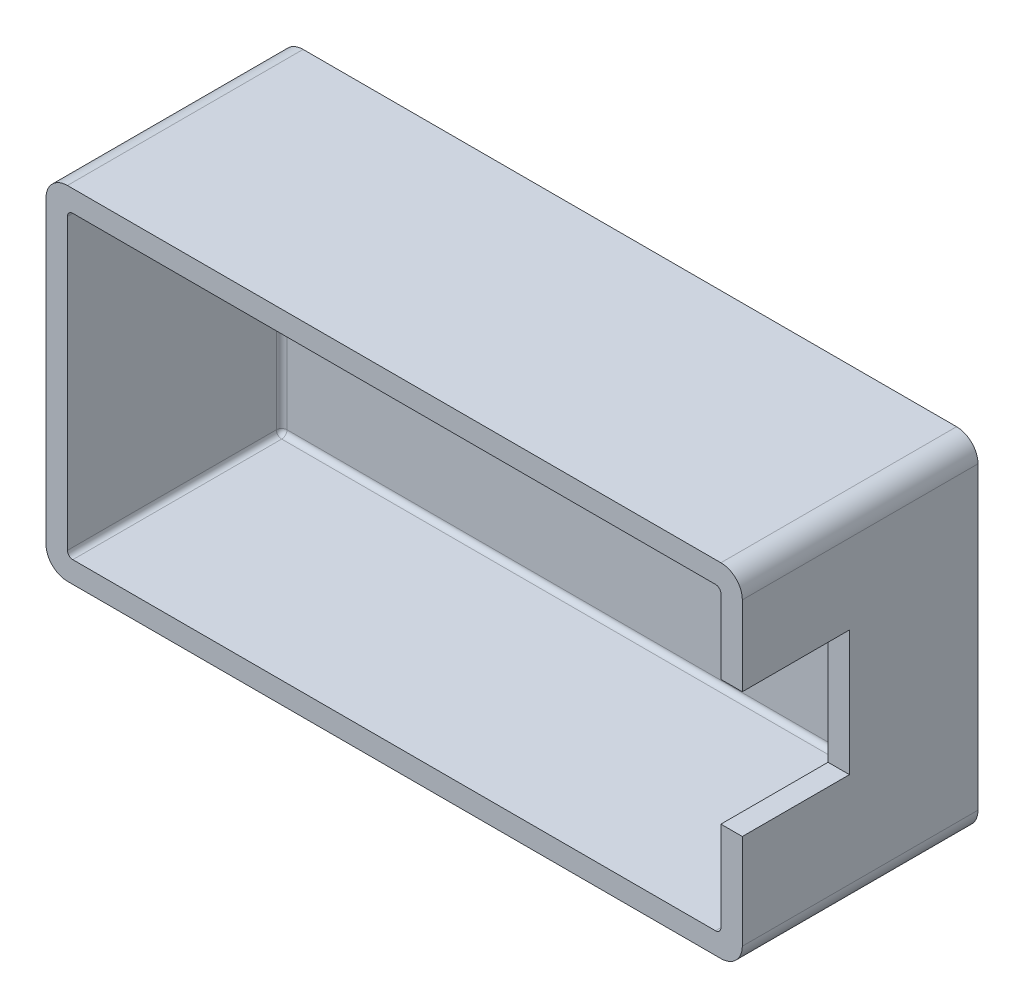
ISO-10303-21;
HEADER;
FILE_DESCRIPTION(('STEP AP214'),'2;1');
FILE_NAME('part.step','',(''),(''),'','','');
FILE_SCHEMA(('AUTOMOTIVE_DESIGN { 1 0 10303 214 1 1 1 1 }'));
ENDSEC;
DATA;
#1=APPLICATION_CONTEXT('core data for automotive mechanical design processes');
#2=APPLICATION_PROTOCOL_DEFINITION('international standard','automotive_design',2000,#1);
#3=PRODUCT_CONTEXT('',#1,'mechanical');
#4=PRODUCT('Part','Part','',(#3));
#5=PRODUCT_RELATED_PRODUCT_CATEGORY('part','',(#4));
#6=PRODUCT_DEFINITION_FORMATION('','',#4);
#7=PRODUCT_DEFINITION_CONTEXT('part definition',#1,'design');
#8=PRODUCT_DEFINITION('design','',#6,#7);
#9=PRODUCT_DEFINITION_SHAPE('','',#8);
#10=(LENGTH_UNIT() NAMED_UNIT(*) SI_UNIT(.MILLI.,.METRE.));
#11=(NAMED_UNIT(*) PLANE_ANGLE_UNIT() SI_UNIT($,.RADIAN.));
#12=(NAMED_UNIT(*) SI_UNIT($,.STERADIAN.) SOLID_ANGLE_UNIT());
#13=UNCERTAINTY_MEASURE_WITH_UNIT(LENGTH_MEASURE(1.E-05),#10,'distance_accuracy_value','');
#14=(GEOMETRIC_REPRESENTATION_CONTEXT(3) GLOBAL_UNCERTAINTY_ASSIGNED_CONTEXT((#13)) GLOBAL_UNIT_ASSIGNED_CONTEXT((#10,
#11,#12)) REPRESENTATION_CONTEXT('',''));
#15=CARTESIAN_POINT('',(0.,0.,0.));
#16=DIRECTION('',(0.,0.,1.));
#17=DIRECTION('',(1.,0.,0.));
#18=AXIS2_PLACEMENT_3D('',#15,#16,#17);
#19=CARTESIAN_POINT('',(0.,0.,2.));
#20=DIRECTION('',(1.,0.,0.));
#21=DIRECTION('',(0.,0.,-1.));
#22=AXIS2_PLACEMENT_3D('',#19,#20,#21);
#23=PLANE('',#22);
#24=DIRECTION('',(0.,-1.,0.));
#25=VECTOR('',#24,1.);
#26=CARTESIAN_POINT('',(0.,0.,0.));
#27=LINE('',#26,#25);
#28=CARTESIAN_POINT('',(0.,30.,0.));
#29=VERTEX_POINT('',#28);
#30=CARTESIAN_POINT('',(0.,2.,0.));
#31=VERTEX_POINT('',#30);
#32=EDGE_CURVE('E246',#29,#31,#27,.T.);
#33=ORIENTED_EDGE('',*,*,#32,.T.);
#34=DIRECTION('',(0.,0.,-1.));
#35=VECTOR('',#34,1.);
#36=CARTESIAN_POINT('',(0.,2.,2.));
#37=LINE('',#36,#35);
#38=CARTESIAN_POINT('',(0.,2.,22.));
#39=VERTEX_POINT('',#38);
#40=EDGE_CURVE('E348',#31,#39,#37,.F.);
#41=ORIENTED_EDGE('',*,*,#40,.T.);
#42=DIRECTION('',(0.,-1.,0.));
#43=VECTOR('',#42,1.);
#44=CARTESIAN_POINT('',(0.,32.,22.));
#45=LINE('',#44,#43);
#46=CARTESIAN_POINT('',(0.,30.,22.));
#47=VERTEX_POINT('',#46);
#48=EDGE_CURVE('E238',#47,#39,#45,.T.);
#49=ORIENTED_EDGE('',*,*,#48,.F.);
#50=DIRECTION('',(0.,0.,-1.));
#51=VECTOR('',#50,1.);
#52=CARTESIAN_POINT('',(0.,30.,2.));
#53=LINE('',#52,#51);
#54=EDGE_CURVE('E345',#47,#29,#53,.T.);
#55=ORIENTED_EDGE('',*,*,#54,.T.);
#56=EDGE_LOOP('',(#33,#41,#49,#55));
#57=FACE_BOUND('',#56,.T.);
#58=ADVANCED_FACE('F33',(#57),#23,.F.);
#59=CARTESIAN_POINT('',(0.,0.,2.));
#60=DIRECTION('',(0.,1.,0.));
#61=DIRECTION('',(0.,0.,1.));
#62=AXIS2_PLACEMENT_3D('',#59,#60,#61);
#63=PLANE('',#62);
#64=DIRECTION('',(1.,0.,0.));
#65=VECTOR('',#64,1.);
#66=CARTESIAN_POINT('',(0.,0.,22.));
#67=LINE('',#66,#65);
#68=CARTESIAN_POINT('',(2.,0.,22.));
#69=VERTEX_POINT('',#68);
#70=CARTESIAN_POINT('',(63.,0.,22.));
#71=VERTEX_POINT('',#70);
#72=EDGE_CURVE('E241',#69,#71,#67,.T.);
#73=ORIENTED_EDGE('',*,*,#72,.F.);
#74=DIRECTION('',(0.,0.,-1.));
#75=VECTOR('',#74,1.);
#76=CARTESIAN_POINT('',(2.,0.,2.));
#77=LINE('',#76,#75);
#78=CARTESIAN_POINT('',(2.,0.,0.));
#79=VERTEX_POINT('',#78);
#80=EDGE_CURVE('E334',#69,#79,#77,.T.);
#81=ORIENTED_EDGE('',*,*,#80,.T.);
#82=DIRECTION('',(1.,0.,0.));
#83=VECTOR('',#82,1.);
#84=CARTESIAN_POINT('',(0.,0.,0.));
#85=LINE('',#84,#83);
#86=CARTESIAN_POINT('',(63.,0.,0.));
#87=VERTEX_POINT('',#86);
#88=EDGE_CURVE('E249',#79,#87,#85,.T.);
#89=ORIENTED_EDGE('',*,*,#88,.T.);
#90=DIRECTION('',(0.,0.,-1.));
#91=VECTOR('',#90,1.);
#92=CARTESIAN_POINT('',(63.,0.,2.));
#93=LINE('',#92,#91);
#94=EDGE_CURVE('E299',#87,#71,#93,.F.);
#95=ORIENTED_EDGE('',*,*,#94,.T.);
#96=EDGE_LOOP('',(#73,#81,#89,#95));
#97=FACE_BOUND('',#96,.T.);
#98=ADVANCED_FACE('F391',(#97),#63,.F.);
#99=CARTESIAN_POINT('',(65.,0.,2.));
#100=DIRECTION('',(-1.,0.,0.));
#101=DIRECTION('',(0.,0.,1.));
#102=AXIS2_PLACEMENT_3D('',#99,#100,#101);
#103=PLANE('',#102);
#104=DIRECTION('',(0.,1.,0.));
#105=VECTOR('',#104,1.);
#106=CARTESIAN_POINT('',(65.,0.,22.));
#107=LINE('',#106,#105);
#108=CARTESIAN_POINT('',(65.,2.,22.));
#109=VERTEX_POINT('',#108);
#110=CARTESIAN_POINT('',(65.,10.8704447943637,22.));
#111=VERTEX_POINT('',#110);
#112=EDGE_CURVE('E244',#109,#111,#107,.T.);
#113=ORIENTED_EDGE('',*,*,#112,.F.);
#114=DIRECTION('',(0.,0.,-1.));
#115=VECTOR('',#114,1.);
#116=CARTESIAN_POINT('',(65.,2.,2.));
#117=LINE('',#116,#115);
#118=CARTESIAN_POINT('',(65.,2.,0.));
#119=VERTEX_POINT('',#118);
#120=EDGE_CURVE('E359',#109,#119,#117,.T.);
#121=ORIENTED_EDGE('',*,*,#120,.T.);
#122=DIRECTION('',(0.,1.,0.));
#123=VECTOR('',#122,1.);
#124=CARTESIAN_POINT('',(65.,0.,0.));
#125=LINE('',#124,#123);
#126=CARTESIAN_POINT('',(65.,30.,0.));
#127=VERTEX_POINT('',#126);
#128=EDGE_CURVE('E252',#119,#127,#125,.T.);
#129=ORIENTED_EDGE('',*,*,#128,.T.);
#130=DIRECTION('',(0.,0.,-1.));
#131=VECTOR('',#130,1.);
#132=CARTESIAN_POINT('',(65.,30.,2.));
#133=LINE('',#132,#131);
#134=CARTESIAN_POINT('',(65.,30.,22.));
#135=VERTEX_POINT('',#134);
#136=EDGE_CURVE('E357',#127,#135,#133,.F.);
#137=ORIENTED_EDGE('',*,*,#136,.T.);
#138=CARTESIAN_POINT('',(65.,22.5704447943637,22.));
#139=VERTEX_POINT('',#138);
#140=EDGE_CURVE('E243',#139,#135,#107,.T.);
#141=ORIENTED_EDGE('',*,*,#140,.F.);
#142=DIRECTION('',(0.,0.,-1.));
#143=VECTOR('',#142,1.);
#144=CARTESIAN_POINT('',(65.,22.5704447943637,2.));
#145=LINE('',#144,#143);
#146=CARTESIAN_POINT('',(65.,22.5704447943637,12.));
#147=VERTEX_POINT('',#146);
#148=EDGE_CURVE('E216',#139,#147,#145,.T.);
#149=ORIENTED_EDGE('',*,*,#148,.T.);
#150=DIRECTION('',(0.,-1.,0.));
#151=VECTOR('',#150,1.);
#152=CARTESIAN_POINT('',(65.,0.,12.));
#153=LINE('',#152,#151);
#154=CARTESIAN_POINT('',(65.,10.8704447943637,12.));
#155=VERTEX_POINT('',#154);
#156=EDGE_CURVE('E192',#147,#155,#153,.T.);
#157=ORIENTED_EDGE('',*,*,#156,.T.);
#158=DIRECTION('',(0.,0.,1.));
#159=VECTOR('',#158,1.);
#160=CARTESIAN_POINT('',(65.,10.8704447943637,2.));
#161=LINE('',#160,#159);
#162=EDGE_CURVE('E221',#155,#111,#161,.T.);
#163=ORIENTED_EDGE('',*,*,#162,.T.);
#164=EDGE_LOOP('',(#113,#121,#129,#137,#141,#149,#157,#163));
#165=FACE_BOUND('',#164,.T.);
#166=ADVANCED_FACE('F364',(#165),#103,.F.);
#167=CARTESIAN_POINT('',(0.,32.,2.));
#168=DIRECTION('',(0.,-1.,0.));
#169=DIRECTION('',(0.,0.,-1.));
#170=AXIS2_PLACEMENT_3D('',#167,#168,#169);
#171=PLANE('',#170);
#172=DIRECTION('',(-1.,0.,0.));
#173=VECTOR('',#172,1.);
#174=CARTESIAN_POINT('',(65.,32.,22.));
#175=LINE('',#174,#173);
#176=CARTESIAN_POINT('',(63.,32.,22.));
#177=VERTEX_POINT('',#176);
#178=CARTESIAN_POINT('',(2.,32.,22.));
#179=VERTEX_POINT('',#178);
#180=EDGE_CURVE('E236',#177,#179,#175,.T.);
#181=ORIENTED_EDGE('',*,*,#180,.F.);
#182=DIRECTION('',(0.,0.,-1.));
#183=VECTOR('',#182,1.);
#184=CARTESIAN_POINT('',(63.,32.,2.));
#185=LINE('',#184,#183);
#186=CARTESIAN_POINT('',(63.,32.,0.));
#187=VERTEX_POINT('',#186);
#188=EDGE_CURVE('E11',#177,#187,#185,.T.);
#189=ORIENTED_EDGE('',*,*,#188,.T.);
#190=DIRECTION('',(-1.,0.,0.));
#191=VECTOR('',#190,1.);
#192=CARTESIAN_POINT('',(0.,32.,0.));
#193=LINE('',#192,#191);
#194=CARTESIAN_POINT('',(2.,32.,0.));
#195=VERTEX_POINT('',#194);
#196=EDGE_CURVE('E255',#187,#195,#193,.T.);
#197=ORIENTED_EDGE('',*,*,#196,.T.);
#198=DIRECTION('',(0.,0.,-1.));
#199=VECTOR('',#198,1.);
#200=CARTESIAN_POINT('',(2.,32.,2.));
#201=LINE('',#200,#199);
#202=EDGE_CURVE('E41',#195,#179,#201,.F.);
#203=ORIENTED_EDGE('',*,*,#202,.T.);
#204=EDGE_LOOP('',(#181,#189,#197,#203));
#205=FACE_BOUND('',#204,.T.);
#206=ADVANCED_FACE('F375',(#205),#171,.F.);
#207=CARTESIAN_POINT('',(0.,0.,0.));
#208=DIRECTION('',(0.,0.,-1.));
#209=DIRECTION('',(-1.,0.,0.));
#210=AXIS2_PLACEMENT_3D('',#207,#208,#209);
#211=PLANE('',#210);
#212=ORIENTED_EDGE('',*,*,#88,.F.);
#213=CARTESIAN_POINT('',(2.,2.,0.));
#214=DIRECTION('',(0.,0.,-1.));
#215=DIRECTION('',(-1.,0.,0.));
#216=AXIS2_PLACEMENT_3D('',#213,#214,#215);
#217=CIRCLE('',#216,2.);
#218=EDGE_CURVE('E343',#79,#31,#217,.T.);
#219=ORIENTED_EDGE('',*,*,#218,.T.);
#220=ORIENTED_EDGE('',*,*,#32,.F.);
#221=CARTESIAN_POINT('',(2.,30.,0.));
#222=DIRECTION('',(0.,0.,-1.));
#223=DIRECTION('',(-1.,0.,0.));
#224=AXIS2_PLACEMENT_3D('',#221,#222,#223);
#225=CIRCLE('',#224,2.);
#226=EDGE_CURVE('E337',#29,#195,#225,.T.);
#227=ORIENTED_EDGE('',*,*,#226,.T.);
#228=ORIENTED_EDGE('',*,*,#196,.F.);
#229=CARTESIAN_POINT('',(63.,30.,0.));
#230=DIRECTION('',(0.,0.,-1.));
#231=DIRECTION('',(-1.,0.,0.));
#232=AXIS2_PLACEMENT_3D('',#229,#230,#231);
#233=CIRCLE('',#232,2.);
#234=EDGE_CURVE('E339',#187,#127,#233,.T.);
#235=ORIENTED_EDGE('',*,*,#234,.T.);
#236=ORIENTED_EDGE('',*,*,#128,.F.);
#237=CARTESIAN_POINT('',(63.,2.,0.));
#238=DIRECTION('',(0.,0.,-1.));
#239=DIRECTION('',(-1.,0.,0.));
#240=AXIS2_PLACEMENT_3D('',#237,#238,#239);
#241=CIRCLE('',#240,2.);
#242=EDGE_CURVE('E341',#119,#87,#241,.T.);
#243=ORIENTED_EDGE('',*,*,#242,.T.);
#244=EDGE_LOOP('',(#212,#219,#220,#227,#228,#235,#236,#243));
#245=FACE_BOUND('',#244,.T.);
#246=ADVANCED_FACE('F369',(#245),#211,.T.);
#247=CARTESIAN_POINT('',(0.,0.,22.));
#248=DIRECTION('',(0.,0.,1.));
#249=DIRECTION('',(1.,0.,0.));
#250=AXIS2_PLACEMENT_3D('',#247,#248,#249);
#251=PLANE('',#250);
#252=ORIENTED_EDGE('',*,*,#48,.T.);
#253=CARTESIAN_POINT('',(2.,2.,22.));
#254=DIRECTION('',(0.,0.,1.));
#255=DIRECTION('',(1.,0.,0.));
#256=AXIS2_PLACEMENT_3D('',#253,#254,#255);
#257=CIRCLE('',#256,2.);
#258=EDGE_CURVE('E355',#39,#69,#257,.T.);
#259=ORIENTED_EDGE('',*,*,#258,.T.);
#260=ORIENTED_EDGE('',*,*,#72,.T.);
#261=CARTESIAN_POINT('',(63.,2.,22.));
#262=DIRECTION('',(0.,0.,1.));
#263=DIRECTION('',(1.,0.,0.));
#264=AXIS2_PLACEMENT_3D('',#261,#262,#263);
#265=CIRCLE('',#264,2.);
#266=EDGE_CURVE('E48',#71,#109,#265,.T.);
#267=ORIENTED_EDGE('',*,*,#266,.T.);
#268=ORIENTED_EDGE('',*,*,#112,.T.);
#269=DIRECTION('',(-1.,0.,0.));
#270=VECTOR('',#269,1.);
#271=CARTESIAN_POINT('',(73.,10.8704447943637,22.));
#272=LINE('',#271,#270);
#273=CARTESIAN_POINT('',(63.,10.8704447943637,22.));
#274=VERTEX_POINT('',#273);
#275=EDGE_CURVE('E213',#111,#274,#272,.T.);
#276=ORIENTED_EDGE('',*,*,#275,.T.);
#277=DIRECTION('',(0.,1.,0.));
#278=VECTOR('',#277,1.);
#279=CARTESIAN_POINT('',(63.,2.,22.));
#280=LINE('',#279,#278);
#281=CARTESIAN_POINT('',(63.,2.5,22.));
#282=VERTEX_POINT('',#281);
#283=EDGE_CURVE('E234',#282,#274,#280,.T.);
#284=ORIENTED_EDGE('',*,*,#283,.F.);
#285=CARTESIAN_POINT('',(62.5,2.5,22.));
#286=DIRECTION('',(0.,0.,1.));
#287=DIRECTION('',(1.,0.,0.));
#288=AXIS2_PLACEMENT_3D('',#285,#286,#287);
#289=CIRCLE('',#288,0.5);
#290=CARTESIAN_POINT('',(62.5,2.,22.));
#291=VERTEX_POINT('',#290);
#292=EDGE_CURVE('E293',#282,#291,#289,.F.);
#293=ORIENTED_EDGE('',*,*,#292,.T.);
#294=DIRECTION('',(1.,0.,0.));
#295=VECTOR('',#294,1.);
#296=CARTESIAN_POINT('',(2.,2.,22.));
#297=LINE('',#296,#295);
#298=CARTESIAN_POINT('',(2.5,2.,22.));
#299=VERTEX_POINT('',#298);
#300=EDGE_CURVE('E230',#299,#291,#297,.T.);
#301=ORIENTED_EDGE('',*,*,#300,.F.);
#302=CARTESIAN_POINT('',(2.5,2.5,22.));
#303=DIRECTION('',(0.,0.,1.));
#304=DIRECTION('',(1.,0.,0.));
#305=AXIS2_PLACEMENT_3D('',#302,#303,#304);
#306=CIRCLE('',#305,0.5);
#307=CARTESIAN_POINT('',(2.,2.5,22.));
#308=VERTEX_POINT('',#307);
#309=EDGE_CURVE('E291',#299,#308,#306,.F.);
#310=ORIENTED_EDGE('',*,*,#309,.T.);
#311=DIRECTION('',(0.,-1.,0.));
#312=VECTOR('',#311,1.);
#313=CARTESIAN_POINT('',(2.,30.,22.));
#314=LINE('',#313,#312);
#315=CARTESIAN_POINT('',(2.,29.5,22.));
#316=VERTEX_POINT('',#315);
#317=EDGE_CURVE('E227',#316,#308,#314,.T.);
#318=ORIENTED_EDGE('',*,*,#317,.F.);
#319=CARTESIAN_POINT('',(2.5,29.5,22.));
#320=DIRECTION('',(0.,0.,1.));
#321=DIRECTION('',(1.,0.,0.));
#322=AXIS2_PLACEMENT_3D('',#319,#320,#321);
#323=CIRCLE('',#322,0.5);
#324=CARTESIAN_POINT('',(2.50000000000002,30.,22.));
#325=VERTEX_POINT('',#324);
#326=EDGE_CURVE('E297',#316,#325,#323,.F.);
#327=ORIENTED_EDGE('',*,*,#326,.T.);
#328=DIRECTION('',(-1.,0.,0.));
#329=VECTOR('',#328,1.);
#330=CARTESIAN_POINT('',(63.,30.,22.));
#331=LINE('',#330,#329);
#332=CARTESIAN_POINT('',(62.5,30.,22.));
#333=VERTEX_POINT('',#332);
#334=EDGE_CURVE('E224',#333,#325,#331,.T.);
#335=ORIENTED_EDGE('',*,*,#334,.F.);
#336=CARTESIAN_POINT('',(62.5,29.5,22.));
#337=DIRECTION('',(0.,0.,1.));
#338=DIRECTION('',(1.,0.,0.));
#339=AXIS2_PLACEMENT_3D('',#336,#337,#338);
#340=CIRCLE('',#339,0.5);
#341=CARTESIAN_POINT('',(63.,29.5,22.));
#342=VERTEX_POINT('',#341);
#343=EDGE_CURVE('E295',#333,#342,#340,.F.);
#344=ORIENTED_EDGE('',*,*,#343,.T.);
#345=CARTESIAN_POINT('',(63.,22.5704447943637,22.));
#346=VERTEX_POINT('',#345);
#347=EDGE_CURVE('E233',#346,#342,#280,.T.);
#348=ORIENTED_EDGE('',*,*,#347,.F.);
#349=DIRECTION('',(-1.,0.,0.));
#350=VECTOR('',#349,1.);
#351=CARTESIAN_POINT('',(73.,22.5704447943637,22.));
#352=LINE('',#351,#350);
#353=EDGE_CURVE('E196',#139,#346,#352,.T.);
#354=ORIENTED_EDGE('',*,*,#353,.F.);
#355=ORIENTED_EDGE('',*,*,#140,.T.);
#356=CARTESIAN_POINT('',(63.,30.,22.));
#357=DIRECTION('',(0.,0.,1.));
#358=DIRECTION('',(1.,0.,0.));
#359=AXIS2_PLACEMENT_3D('',#356,#357,#358);
#360=CIRCLE('',#359,2.);
#361=EDGE_CURVE('E352',#135,#177,#360,.T.);
#362=ORIENTED_EDGE('',*,*,#361,.T.);
#363=ORIENTED_EDGE('',*,*,#180,.T.);
#364=CARTESIAN_POINT('',(2.,30.,22.));
#365=DIRECTION('',(0.,0.,1.));
#366=DIRECTION('',(1.,0.,0.));
#367=AXIS2_PLACEMENT_3D('',#364,#365,#366);
#368=CIRCLE('',#367,2.);
#369=EDGE_CURVE('E350',#179,#47,#368,.T.);
#370=ORIENTED_EDGE('',*,*,#369,.T.);
#371=EDGE_LOOP('',(#252,#259,#260,#267,#268,#276,#284,#293,#301,#310,#318,#327,#335,#344,#348,
#354,#355,#362,#363,#370));
#372=FACE_BOUND('',#371,.T.);
#373=ADVANCED_FACE('F377',(#372),#251,.T.);
#374=CARTESIAN_POINT('',(63.,30.,22.));
#375=DIRECTION('',(0.,-1.,0.));
#376=DIRECTION('',(1.,0.,0.));
#377=AXIS2_PLACEMENT_3D('',#374,#375,#376);
#378=PLANE('',#377);
#379=DIRECTION('',(-1.,0.,0.));
#380=VECTOR('',#379,1.);
#381=CARTESIAN_POINT('',(63.,30.,2.5));
#382=LINE('',#381,#380);
#383=CARTESIAN_POINT('',(2.5,30.,2.5));
#384=VERTEX_POINT('',#383);
#385=CARTESIAN_POINT('',(62.5,30.,2.5));
#386=VERTEX_POINT('',#385);
#387=EDGE_CURVE('E287',#384,#386,#382,.F.);
#388=ORIENTED_EDGE('',*,*,#387,.T.);
#389=DIRECTION('',(0.,0.,-1.));
#390=VECTOR('',#389,1.);
#391=CARTESIAN_POINT('',(62.5,30.,22.));
#392=LINE('',#391,#390);
#393=EDGE_CURVE('E289',#386,#333,#392,.F.);
#394=ORIENTED_EDGE('',*,*,#393,.T.);
#395=ORIENTED_EDGE('',*,*,#334,.T.);
#396=DIRECTION('',(0.,0.,-1.));
#397=VECTOR('',#396,1.);
#398=CARTESIAN_POINT('',(2.5,30.,2.));
#399=LINE('',#398,#397);
#400=EDGE_CURVE('E285',#325,#384,#399,.T.);
#401=ORIENTED_EDGE('',*,*,#400,.T.);
#402=EDGE_LOOP('',(#388,#394,#395,#401));
#403=FACE_BOUND('',#402,.T.);
#404=ADVANCED_FACE('F500',(#403),#378,.T.);
#405=CARTESIAN_POINT('',(2.,30.,22.));
#406=DIRECTION('',(1.,0.,0.));
#407=DIRECTION('',(0.,1.,0.));
#408=AXIS2_PLACEMENT_3D('',#405,#406,#407);
#409=PLANE('',#408);
#410=ORIENTED_EDGE('',*,*,#317,.T.);
#411=DIRECTION('',(0.,0.,-1.));
#412=VECTOR('',#411,1.);
#413=CARTESIAN_POINT('',(2.,2.5,2.));
#414=LINE('',#413,#412);
#415=CARTESIAN_POINT('',(2.,2.5,2.5));
#416=VERTEX_POINT('',#415);
#417=EDGE_CURVE('E271',#308,#416,#414,.T.);
#418=ORIENTED_EDGE('',*,*,#417,.T.);
#419=DIRECTION('',(0.,-1.,0.));
#420=VECTOR('',#419,1.);
#421=CARTESIAN_POINT('',(2.,30.,2.5));
#422=LINE('',#421,#420);
#423=CARTESIAN_POINT('',(2.,29.5,2.5));
#424=VERTEX_POINT('',#423);
#425=EDGE_CURVE('E268',#416,#424,#422,.F.);
#426=ORIENTED_EDGE('',*,*,#425,.T.);
#427=DIRECTION('',(0.,0.,-1.));
#428=VECTOR('',#427,1.);
#429=CARTESIAN_POINT('',(2.,29.5,22.));
#430=LINE('',#429,#428);
#431=EDGE_CURVE('E266',#424,#316,#430,.F.);
#432=ORIENTED_EDGE('',*,*,#431,.T.);
#433=EDGE_LOOP('',(#410,#418,#426,#432));
#434=FACE_BOUND('',#433,.T.);
#435=ADVANCED_FACE('F495',(#434),#409,.T.);
#436=CARTESIAN_POINT('',(2.,2.,22.));
#437=DIRECTION('',(0.,1.,0.));
#438=DIRECTION('',(-1.,0.,0.));
#439=AXIS2_PLACEMENT_3D('',#436,#437,#438);
#440=PLANE('',#439);
#441=DIRECTION('',(1.,0.,0.));
#442=VECTOR('',#441,1.);
#443=CARTESIAN_POINT('',(2.,2.,2.5));
#444=LINE('',#443,#442);
#445=CARTESIAN_POINT('',(62.5,2.,2.5));
#446=VERTEX_POINT('',#445);
#447=CARTESIAN_POINT('',(2.5,2.,2.5));
#448=VERTEX_POINT('',#447);
#449=EDGE_CURVE('E275',#446,#448,#444,.F.);
#450=ORIENTED_EDGE('',*,*,#449,.T.);
#451=DIRECTION('',(0.,0.,-1.));
#452=VECTOR('',#451,1.);
#453=CARTESIAN_POINT('',(2.5,2.,22.));
#454=LINE('',#453,#452);
#455=EDGE_CURVE('E277',#448,#299,#454,.F.);
#456=ORIENTED_EDGE('',*,*,#455,.T.);
#457=ORIENTED_EDGE('',*,*,#300,.T.);
#458=DIRECTION('',(0.,0.,-1.));
#459=VECTOR('',#458,1.);
#460=CARTESIAN_POINT('',(62.5,2.,2.));
#461=LINE('',#460,#459);
#462=EDGE_CURVE('E273',#291,#446,#461,.T.);
#463=ORIENTED_EDGE('',*,*,#462,.T.);
#464=EDGE_LOOP('',(#450,#456,#457,#463));
#465=FACE_BOUND('',#464,.T.);
#466=ADVANCED_FACE('F485',(#465),#440,.T.);
#467=CARTESIAN_POINT('',(63.,2.,22.));
#468=DIRECTION('',(-1.,0.,0.));
#469=DIRECTION('',(0.,0.,1.));
#470=AXIS2_PLACEMENT_3D('',#467,#468,#469);
#471=PLANE('',#470);
#472=DIRECTION('',(0.,1.,0.));
#473=VECTOR('',#472,1.);
#474=CARTESIAN_POINT('',(63.,2.,2.5));
#475=LINE('',#474,#473);
#476=CARTESIAN_POINT('',(63.,29.5,2.5));
#477=VERTEX_POINT('',#476);
#478=CARTESIAN_POINT('',(63.,2.5,2.5));
#479=VERTEX_POINT('',#478);
#480=EDGE_CURVE('E281',#477,#479,#475,.F.);
#481=ORIENTED_EDGE('',*,*,#480,.T.);
#482=DIRECTION('',(0.,0.,-1.));
#483=VECTOR('',#482,1.);
#484=CARTESIAN_POINT('',(63.,2.5,22.));
#485=LINE('',#484,#483);
#486=EDGE_CURVE('E283',#479,#282,#485,.F.);
#487=ORIENTED_EDGE('',*,*,#486,.T.);
#488=ORIENTED_EDGE('',*,*,#283,.T.);
#489=DIRECTION('',(0.,0.,1.));
#490=VECTOR('',#489,1.);
#491=CARTESIAN_POINT('',(63.,10.8704447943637,22.));
#492=LINE('',#491,#490);
#493=CARTESIAN_POINT('',(63.,10.8704447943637,12.));
#494=VERTEX_POINT('',#493);
#495=EDGE_CURVE('E209',#494,#274,#492,.T.);
#496=ORIENTED_EDGE('',*,*,#495,.F.);
#497=DIRECTION('',(0.,-1.,0.));
#498=VECTOR('',#497,1.);
#499=CARTESIAN_POINT('',(63.,22.5704447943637,12.));
#500=LINE('',#499,#498);
#501=CARTESIAN_POINT('',(63.,22.5704447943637,12.));
#502=VERTEX_POINT('',#501);
#503=EDGE_CURVE('E189',#502,#494,#500,.T.);
#504=ORIENTED_EDGE('',*,*,#503,.F.);
#505=DIRECTION('',(0.,0.,-1.));
#506=VECTOR('',#505,1.);
#507=CARTESIAN_POINT('',(63.,22.5704447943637,22.));
#508=LINE('',#507,#506);
#509=EDGE_CURVE('E199',#346,#502,#508,.T.);
#510=ORIENTED_EDGE('',*,*,#509,.F.);
#511=ORIENTED_EDGE('',*,*,#347,.T.);
#512=DIRECTION('',(0.,0.,-1.));
#513=VECTOR('',#512,1.);
#514=CARTESIAN_POINT('',(63.,29.5,2.));
#515=LINE('',#514,#513);
#516=EDGE_CURVE('E279',#342,#477,#515,.T.);
#517=ORIENTED_EDGE('',*,*,#516,.T.);
#518=EDGE_LOOP('',(#481,#487,#488,#496,#504,#510,#511,#517));
#519=FACE_BOUND('',#518,.T.);
#520=ADVANCED_FACE('F207',(#519),#471,.T.);
#521=CARTESIAN_POINT('',(0.,0.,2.));
#522=DIRECTION('',(0.,0.,-1.));
#523=DIRECTION('',(-1.,0.,0.));
#524=AXIS2_PLACEMENT_3D('',#521,#522,#523);
#525=PLANE('',#524);
#526=DIRECTION('',(-1.,0.,0.));
#527=VECTOR('',#526,1.);
#528=CARTESIAN_POINT('',(0.,29.5,2.));
#529=LINE('',#528,#527);
#530=CARTESIAN_POINT('',(62.5,29.5,2.));
#531=VERTEX_POINT('',#530);
#532=CARTESIAN_POINT('',(2.5,29.5,2.));
#533=VERTEX_POINT('',#532);
#534=EDGE_CURVE('E257',#531,#533,#529,.T.);
#535=ORIENTED_EDGE('',*,*,#534,.T.);
#536=DIRECTION('',(0.,-1.,0.));
#537=VECTOR('',#536,1.);
#538=CARTESIAN_POINT('',(2.5,0.,2.));
#539=LINE('',#538,#537);
#540=CARTESIAN_POINT('',(2.5,2.5,2.));
#541=VERTEX_POINT('',#540);
#542=EDGE_CURVE('E263',#533,#541,#539,.T.);
#543=ORIENTED_EDGE('',*,*,#542,.T.);
#544=DIRECTION('',(1.,0.,0.));
#545=VECTOR('',#544,1.);
#546=CARTESIAN_POINT('',(0.,2.5,2.));
#547=LINE('',#546,#545);
#548=CARTESIAN_POINT('',(62.5,2.5,2.));
#549=VERTEX_POINT('',#548);
#550=EDGE_CURVE('E261',#541,#549,#547,.T.);
#551=ORIENTED_EDGE('',*,*,#550,.T.);
#552=DIRECTION('',(0.,1.,0.));
#553=VECTOR('',#552,1.);
#554=CARTESIAN_POINT('',(62.5,0.,2.));
#555=LINE('',#554,#553);
#556=EDGE_CURVE('E259',#549,#531,#555,.T.);
#557=ORIENTED_EDGE('',*,*,#556,.T.);
#558=EDGE_LOOP('',(#535,#543,#551,#557));
#559=FACE_BOUND('',#558,.T.);
#560=ADVANCED_FACE('F476',(#559),#525,.F.);
#561=CARTESIAN_POINT('',(73.,10.8704447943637,22.));
#562=DIRECTION('',(0.,-1.,0.));
#563=DIRECTION('',(0.,0.,-1.));
#564=AXIS2_PLACEMENT_3D('',#561,#562,#563);
#565=PLANE('',#564);
#566=DIRECTION('',(-1.,0.,0.));
#567=VECTOR('',#566,1.);
#568=CARTESIAN_POINT('',(73.,10.8704447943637,12.));
#569=LINE('',#568,#567);
#570=EDGE_CURVE('E195',#155,#494,#569,.T.);
#571=ORIENTED_EDGE('',*,*,#570,.T.);
#572=ORIENTED_EDGE('',*,*,#495,.T.);
#573=ORIENTED_EDGE('',*,*,#275,.F.);
#574=ORIENTED_EDGE('',*,*,#162,.F.);
#575=EDGE_LOOP('',(#571,#572,#573,#574));
#576=FACE_BOUND('',#575,.T.);
#577=ADVANCED_FACE('F513',(#576),#565,.F.);
#578=CARTESIAN_POINT('',(73.,22.5704447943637,12.));
#579=DIRECTION('',(0.,0.,-1.));
#580=DIRECTION('',(0.,1.,0.));
#581=AXIS2_PLACEMENT_3D('',#578,#579,#580);
#582=PLANE('',#581);
#583=DIRECTION('',(-1.,0.,0.));
#584=VECTOR('',#583,1.);
#585=CARTESIAN_POINT('',(73.,22.5704447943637,12.));
#586=LINE('',#585,#584);
#587=EDGE_CURVE('E184',#147,#502,#586,.T.);
#588=ORIENTED_EDGE('',*,*,#587,.T.);
#589=ORIENTED_EDGE('',*,*,#503,.T.);
#590=ORIENTED_EDGE('',*,*,#570,.F.);
#591=ORIENTED_EDGE('',*,*,#156,.F.);
#592=EDGE_LOOP('',(#588,#589,#590,#591));
#593=FACE_BOUND('',#592,.T.);
#594=ADVANCED_FACE('F186',(#593),#582,.F.);
#595=CARTESIAN_POINT('',(73.,22.5704447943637,22.));
#596=DIRECTION('',(0.,1.,0.));
#597=DIRECTION('',(0.,0.,1.));
#598=AXIS2_PLACEMENT_3D('',#595,#596,#597);
#599=PLANE('',#598);
#600=ORIENTED_EDGE('',*,*,#353,.T.);
#601=ORIENTED_EDGE('',*,*,#509,.T.);
#602=ORIENTED_EDGE('',*,*,#587,.F.);
#603=ORIENTED_EDGE('',*,*,#148,.F.);
#604=EDGE_LOOP('',(#600,#601,#602,#603));
#605=FACE_BOUND('',#604,.T.);
#606=ADVANCED_FACE('F200',(#605),#599,.F.);
#607=CARTESIAN_POINT('',(62.5,29.5,22.));
#608=DIRECTION('',(0.,0.,1.));
#609=DIRECTION('',(1.,0.,0.));
#610=AXIS2_PLACEMENT_3D('',#607,#608,#609);
#611=CYLINDRICAL_SURFACE('',#610,0.5);
#612=ORIENTED_EDGE('',*,*,#343,.F.);
#613=ORIENTED_EDGE('',*,*,#393,.F.);
#614=CARTESIAN_POINT('',(62.5,29.5,2.5));
#615=DIRECTION('',(0.,0.,1.));
#616=DIRECTION('',(1.,0.,0.));
#617=AXIS2_PLACEMENT_3D('',#614,#615,#616);
#618=CIRCLE('',#617,0.5);
#619=EDGE_CURVE('E205',#477,#386,#618,.T.);
#620=ORIENTED_EDGE('',*,*,#619,.F.);
#621=ORIENTED_EDGE('',*,*,#516,.F.);
#622=EDGE_LOOP('',(#612,#613,#620,#621));
#623=FACE_BOUND('',#622,.T.);
#624=ADVANCED_FACE('F452',(#623),#611,.F.);
#625=CARTESIAN_POINT('',(62.5,0.,2.5));
#626=DIRECTION('',(0.,1.,0.));
#627=DIRECTION('',(0.,0.,1.));
#628=AXIS2_PLACEMENT_3D('',#625,#626,#627);
#629=CYLINDRICAL_SURFACE('',#628,0.5);
#630=CARTESIAN_POINT('',(62.5,2.5,2.5));
#631=DIRECTION('',(0.,1.,0.));
#632=DIRECTION('',(0.,0.,1.));
#633=AXIS2_PLACEMENT_3D('',#630,#631,#632);
#634=CIRCLE('',#633,0.5);
#635=EDGE_CURVE('E325',#479,#549,#634,.T.);
#636=ORIENTED_EDGE('',*,*,#635,.F.);
#637=ORIENTED_EDGE('',*,*,#480,.F.);
#638=CARTESIAN_POINT('',(62.5,29.5,2.5));
#639=DIRECTION('',(0.,-1.,0.));
#640=DIRECTION('',(0.,0.,-1.));
#641=AXIS2_PLACEMENT_3D('',#638,#639,#640);
#642=CIRCLE('',#641,0.5);
#643=EDGE_CURVE('E328',#531,#477,#642,.T.);
#644=ORIENTED_EDGE('',*,*,#643,.F.);
#645=ORIENTED_EDGE('',*,*,#556,.F.);
#646=EDGE_LOOP('',(#636,#637,#644,#645));
#647=FACE_BOUND('',#646,.T.);
#648=ADVANCED_FACE('F448',(#647),#629,.F.);
#649=CARTESIAN_POINT('',(62.5,2.5,22.));
#650=DIRECTION('',(0.,0.,1.));
#651=DIRECTION('',(1.,0.,0.));
#652=AXIS2_PLACEMENT_3D('',#649,#650,#651);
#653=CYLINDRICAL_SURFACE('',#652,0.5);
#654=ORIENTED_EDGE('',*,*,#292,.F.);
#655=ORIENTED_EDGE('',*,*,#486,.F.);
#656=CARTESIAN_POINT('',(62.5,2.5,2.5));
#657=DIRECTION('',(0.,0.,1.));
#658=DIRECTION('',(1.,0.,0.));
#659=AXIS2_PLACEMENT_3D('',#656,#657,#658);
#660=CIRCLE('',#659,0.5);
#661=EDGE_CURVE('E322',#446,#479,#660,.T.);
#662=ORIENTED_EDGE('',*,*,#661,.F.);
#663=ORIENTED_EDGE('',*,*,#462,.F.);
#664=EDGE_LOOP('',(#654,#655,#662,#663));
#665=FACE_BOUND('',#664,.T.);
#666=ADVANCED_FACE('F444',(#665),#653,.F.);
#667=CARTESIAN_POINT('',(62.5,29.5,2.5));
#668=DIRECTION('',(0.,0.,1.));
#669=DIRECTION('',(1.,0.,0.));
#670=AXIS2_PLACEMENT_3D('',#667,#668,#669);
#671=SPHERICAL_SURFACE('',#670,0.5);
#672=ORIENTED_EDGE('',*,*,#643,.T.);
#673=ORIENTED_EDGE('',*,*,#619,.T.);
#674=CARTESIAN_POINT('',(62.5,29.5,2.5));
#675=DIRECTION('',(-1.,0.,0.));
#676=DIRECTION('',(0.,0.,1.));
#677=AXIS2_PLACEMENT_3D('',#674,#675,#676);
#678=CIRCLE('',#677,0.5);
#679=EDGE_CURVE('E319',#531,#386,#678,.F.);
#680=ORIENTED_EDGE('',*,*,#679,.F.);
#681=EDGE_LOOP('',(#672,#673,#680));
#682=FACE_BOUND('',#681,.T.);
#683=ADVANCED_FACE('F440',(#682),#671,.F.);
#684=CARTESIAN_POINT('',(62.5,2.5,2.5));
#685=DIRECTION('',(0.,0.,1.));
#686=DIRECTION('',(1.,0.,0.));
#687=AXIS2_PLACEMENT_3D('',#684,#685,#686);
#688=SPHERICAL_SURFACE('',#687,0.5);
#689=ORIENTED_EDGE('',*,*,#661,.T.);
#690=ORIENTED_EDGE('',*,*,#635,.T.);
#691=CARTESIAN_POINT('',(62.5,2.5,2.5));
#692=DIRECTION('',(-1.,0.,0.));
#693=DIRECTION('',(0.,0.,1.));
#694=AXIS2_PLACEMENT_3D('',#691,#692,#693);
#695=CIRCLE('',#694,0.5);
#696=EDGE_CURVE('E316',#446,#549,#695,.F.);
#697=ORIENTED_EDGE('',*,*,#696,.F.);
#698=EDGE_LOOP('',(#689,#690,#697));
#699=FACE_BOUND('',#698,.T.);
#700=ADVANCED_FACE('F436',(#699),#688,.F.);
#701=CARTESIAN_POINT('',(2.5,29.5,22.));
#702=DIRECTION('',(0.,0.,1.));
#703=DIRECTION('',(1.,0.,0.));
#704=AXIS2_PLACEMENT_3D('',#701,#702,#703);
#705=CYLINDRICAL_SURFACE('',#704,0.5);
#706=ORIENTED_EDGE('',*,*,#326,.F.);
#707=ORIENTED_EDGE('',*,*,#431,.F.);
#708=CARTESIAN_POINT('',(2.5,29.5,2.5));
#709=DIRECTION('',(0.,0.,1.));
#710=DIRECTION('',(1.,0.,0.));
#711=AXIS2_PLACEMENT_3D('',#708,#709,#710);
#712=CIRCLE('',#711,0.5);
#713=EDGE_CURVE('E313',#384,#424,#712,.T.);
#714=ORIENTED_EDGE('',*,*,#713,.F.);
#715=ORIENTED_EDGE('',*,*,#400,.F.);
#716=EDGE_LOOP('',(#706,#707,#714,#715));
#717=FACE_BOUND('',#716,.T.);
#718=ADVANCED_FACE('F432',(#717),#705,.F.);
#719=CARTESIAN_POINT('',(0.,29.5,2.5));
#720=DIRECTION('',(-1.,0.,0.));
#721=DIRECTION('',(0.,-1.,0.));
#722=AXIS2_PLACEMENT_3D('',#719,#720,#721);
#723=CYLINDRICAL_SURFACE('',#722,0.5);
#724=ORIENTED_EDGE('',*,*,#679,.T.);
#725=ORIENTED_EDGE('',*,*,#387,.F.);
#726=CARTESIAN_POINT('',(2.5,29.5,2.5));
#727=DIRECTION('',(1.,0.,0.));
#728=DIRECTION('',(0.,1.,0.));
#729=AXIS2_PLACEMENT_3D('',#726,#727,#728);
#730=CIRCLE('',#729,0.5);
#731=EDGE_CURVE('E310',#533,#384,#730,.T.);
#732=ORIENTED_EDGE('',*,*,#731,.F.);
#733=ORIENTED_EDGE('',*,*,#534,.F.);
#734=EDGE_LOOP('',(#724,#725,#732,#733));
#735=FACE_BOUND('',#734,.T.);
#736=ADVANCED_FACE('F428',(#735),#723,.F.);
#737=CARTESIAN_POINT('',(0.,2.5,2.5));
#738=DIRECTION('',(1.,0.,0.));
#739=DIRECTION('',(0.,1.,0.));
#740=AXIS2_PLACEMENT_3D('',#737,#738,#739);
#741=CYLINDRICAL_SURFACE('',#740,0.5);
#742=ORIENTED_EDGE('',*,*,#696,.T.);
#743=ORIENTED_EDGE('',*,*,#550,.F.);
#744=CARTESIAN_POINT('',(2.5,2.5,2.5));
#745=DIRECTION('',(1.,0.,0.));
#746=DIRECTION('',(0.,0.,-1.));
#747=AXIS2_PLACEMENT_3D('',#744,#745,#746);
#748=CIRCLE('',#747,0.5);
#749=EDGE_CURVE('E307',#448,#541,#748,.T.);
#750=ORIENTED_EDGE('',*,*,#749,.F.);
#751=ORIENTED_EDGE('',*,*,#449,.F.);
#752=EDGE_LOOP('',(#742,#743,#750,#751));
#753=FACE_BOUND('',#752,.T.);
#754=ADVANCED_FACE('F424',(#753),#741,.F.);
#755=CARTESIAN_POINT('',(2.5,2.5,22.));
#756=DIRECTION('',(0.,0.,1.));
#757=DIRECTION('',(1.,0.,0.));
#758=AXIS2_PLACEMENT_3D('',#755,#756,#757);
#759=CYLINDRICAL_SURFACE('',#758,0.5);
#760=ORIENTED_EDGE('',*,*,#309,.F.);
#761=ORIENTED_EDGE('',*,*,#455,.F.);
#762=CARTESIAN_POINT('',(2.5,2.5,2.5));
#763=DIRECTION('',(0.,0.,1.));
#764=DIRECTION('',(1.,0.,0.));
#765=AXIS2_PLACEMENT_3D('',#762,#763,#764);
#766=CIRCLE('',#765,0.5);
#767=EDGE_CURVE('E304',#416,#448,#766,.T.);
#768=ORIENTED_EDGE('',*,*,#767,.F.);
#769=ORIENTED_EDGE('',*,*,#417,.F.);
#770=EDGE_LOOP('',(#760,#761,#768,#769));
#771=FACE_BOUND('',#770,.T.);
#772=ADVANCED_FACE('F420',(#771),#759,.F.);
#773=CARTESIAN_POINT('',(2.5,29.5,2.5));
#774=DIRECTION('',(0.,0.,1.));
#775=DIRECTION('',(1.,0.,0.));
#776=AXIS2_PLACEMENT_3D('',#773,#774,#775);
#777=SPHERICAL_SURFACE('',#776,0.5);
#778=ORIENTED_EDGE('',*,*,#731,.T.);
#779=ORIENTED_EDGE('',*,*,#713,.T.);
#780=CARTESIAN_POINT('',(2.5,29.5,2.5));
#781=DIRECTION('',(0.,-1.,0.));
#782=DIRECTION('',(0.,0.,-1.));
#783=AXIS2_PLACEMENT_3D('',#780,#781,#782);
#784=CIRCLE('',#783,0.5);
#785=EDGE_CURVE('E302',#533,#424,#784,.F.);
#786=ORIENTED_EDGE('',*,*,#785,.F.);
#787=EDGE_LOOP('',(#778,#779,#786));
#788=FACE_BOUND('',#787,.T.);
#789=ADVANCED_FACE('F416',(#788),#777,.F.);
#790=CARTESIAN_POINT('',(2.5,2.5,2.5));
#791=DIRECTION('',(0.,0.,1.));
#792=DIRECTION('',(1.,0.,0.));
#793=AXIS2_PLACEMENT_3D('',#790,#791,#792);
#794=SPHERICAL_SURFACE('',#793,0.5);
#795=ORIENTED_EDGE('',*,*,#767,.T.);
#796=ORIENTED_EDGE('',*,*,#749,.T.);
#797=CARTESIAN_POINT('',(2.5,2.5,2.5));
#798=DIRECTION('',(0.,1.,0.));
#799=DIRECTION('',(-1.,0.,0.));
#800=AXIS2_PLACEMENT_3D('',#797,#798,#799);
#801=CIRCLE('',#800,0.5);
#802=EDGE_CURVE('E300',#416,#541,#801,.F.);
#803=ORIENTED_EDGE('',*,*,#802,.F.);
#804=EDGE_LOOP('',(#795,#796,#803));
#805=FACE_BOUND('',#804,.T.);
#806=ADVANCED_FACE('F412',(#805),#794,.F.);
#807=CARTESIAN_POINT('',(2.5,0.,2.5));
#808=DIRECTION('',(0.,-1.,0.));
#809=DIRECTION('',(1.,0.,0.));
#810=AXIS2_PLACEMENT_3D('',#807,#808,#809);
#811=CYLINDRICAL_SURFACE('',#810,0.5);
#812=ORIENTED_EDGE('',*,*,#785,.T.);
#813=ORIENTED_EDGE('',*,*,#425,.F.);
#814=ORIENTED_EDGE('',*,*,#802,.T.);
#815=ORIENTED_EDGE('',*,*,#542,.F.);
#816=EDGE_LOOP('',(#812,#813,#814,#815));
#817=FACE_BOUND('',#816,.T.);
#818=ADVANCED_FACE('F400',(#817),#811,.F.);
#819=CARTESIAN_POINT('',(2.,2.,2.));
#820=DIRECTION('',(0.,0.,-1.));
#821=DIRECTION('',(-1.,0.,0.));
#822=AXIS2_PLACEMENT_3D('',#819,#820,#821);
#823=CYLINDRICAL_SURFACE('',#822,2.);
#824=ORIENTED_EDGE('',*,*,#258,.F.);
#825=ORIENTED_EDGE('',*,*,#40,.F.);
#826=ORIENTED_EDGE('',*,*,#218,.F.);
#827=ORIENTED_EDGE('',*,*,#80,.F.);
#828=EDGE_LOOP('',(#824,#825,#826,#827));
#829=FACE_BOUND('',#828,.T.);
#830=ADVANCED_FACE('F388',(#829),#823,.T.);
#831=CARTESIAN_POINT('',(63.,2.,2.));
#832=DIRECTION('',(0.,0.,-1.));
#833=DIRECTION('',(-1.,0.,0.));
#834=AXIS2_PLACEMENT_3D('',#831,#832,#833);
#835=CYLINDRICAL_SURFACE('',#834,2.);
#836=ORIENTED_EDGE('',*,*,#266,.F.);
#837=ORIENTED_EDGE('',*,*,#94,.F.);
#838=ORIENTED_EDGE('',*,*,#242,.F.);
#839=ORIENTED_EDGE('',*,*,#120,.F.);
#840=EDGE_LOOP('',(#836,#837,#838,#839));
#841=FACE_BOUND('',#840,.T.);
#842=ADVANCED_FACE('F393',(#841),#835,.T.);
#843=CARTESIAN_POINT('',(63.,30.,2.));
#844=DIRECTION('',(0.,0.,-1.));
#845=DIRECTION('',(-1.,0.,0.));
#846=AXIS2_PLACEMENT_3D('',#843,#844,#845);
#847=CYLINDRICAL_SURFACE('',#846,2.);
#848=ORIENTED_EDGE('',*,*,#361,.F.);
#849=ORIENTED_EDGE('',*,*,#136,.F.);
#850=ORIENTED_EDGE('',*,*,#234,.F.);
#851=ORIENTED_EDGE('',*,*,#188,.F.);
#852=EDGE_LOOP('',(#848,#849,#850,#851));
#853=FACE_BOUND('',#852,.T.);
#854=ADVANCED_FACE('F374',(#853),#847,.T.);
#855=CARTESIAN_POINT('',(2.,30.,2.));
#856=DIRECTION('',(0.,0.,-1.));
#857=DIRECTION('',(-1.,0.,0.));
#858=AXIS2_PLACEMENT_3D('',#855,#856,#857);
#859=CYLINDRICAL_SURFACE('',#858,2.);
#860=ORIENTED_EDGE('',*,*,#369,.F.);
#861=ORIENTED_EDGE('',*,*,#202,.F.);
#862=ORIENTED_EDGE('',*,*,#226,.F.);
#863=ORIENTED_EDGE('',*,*,#54,.F.);
#864=EDGE_LOOP('',(#860,#861,#862,#863));
#865=FACE_BOUND('',#864,.T.);
#866=ADVANCED_FACE('F35',(#865),#859,.T.);
#867=CLOSED_SHELL('',(#58,#98,#166,#206,#246,#373,#404,#435,#466,#520,#560,#577,#594,#606,#624,
#648,#666,#683,#700,#718,#736,#754,#772,#789,#806,#818,#830,#842,#854,#866));
#868=MANIFOLD_SOLID_BREP('B2',#867);
#869=ADVANCED_BREP_SHAPE_REPRESENTATION('',(#18,#868),#14);
#870=SHAPE_DEFINITION_REPRESENTATION(#9,#869);
ENDSEC;
END-ISO-10303-21;
